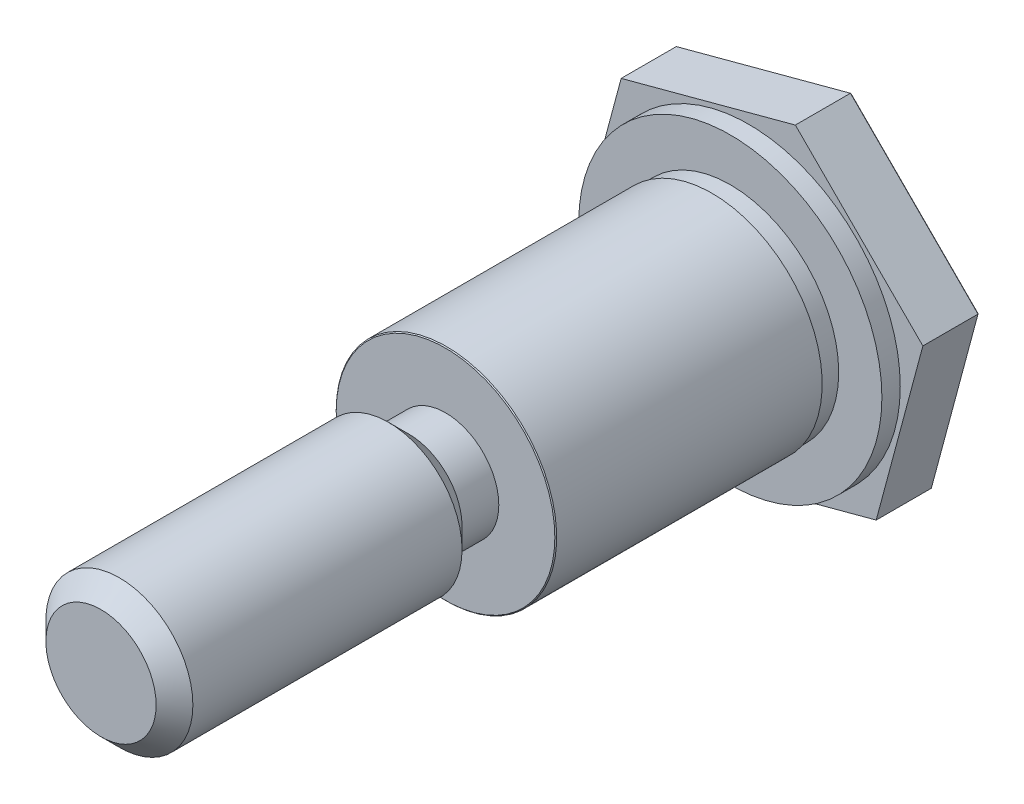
ISO-10303-21;
HEADER;
FILE_DESCRIPTION(('STEP AP214'),'2;1');
FILE_NAME('part.step','',(''),(''),'','','');
FILE_SCHEMA(('AUTOMOTIVE_DESIGN { 1 0 10303 214 1 1 1 1 }'));
ENDSEC;
DATA;
#1=APPLICATION_CONTEXT('core data for automotive mechanical design processes');
#2=APPLICATION_PROTOCOL_DEFINITION('international standard','automotive_design',2000,#1);
#3=PRODUCT_CONTEXT('',#1,'mechanical');
#4=PRODUCT('Part','Part','',(#3));
#5=PRODUCT_RELATED_PRODUCT_CATEGORY('part','',(#4));
#6=PRODUCT_DEFINITION_FORMATION('','',#4);
#7=PRODUCT_DEFINITION_CONTEXT('part definition',#1,'design');
#8=PRODUCT_DEFINITION('design','',#6,#7);
#9=PRODUCT_DEFINITION_SHAPE('','',#8);
#10=(LENGTH_UNIT() NAMED_UNIT(*) SI_UNIT(.MILLI.,.METRE.));
#11=(NAMED_UNIT(*) PLANE_ANGLE_UNIT() SI_UNIT($,.RADIAN.));
#12=(NAMED_UNIT(*) SI_UNIT($,.STERADIAN.) SOLID_ANGLE_UNIT());
#13=UNCERTAINTY_MEASURE_WITH_UNIT(LENGTH_MEASURE(1.E-05),#10,'distance_accuracy_value','');
#14=(GEOMETRIC_REPRESENTATION_CONTEXT(3) GLOBAL_UNCERTAINTY_ASSIGNED_CONTEXT((#13)) GLOBAL_UNIT_ASSIGNED_CONTEXT((#10,
#11,#12)) REPRESENTATION_CONTEXT('',''));
#15=CARTESIAN_POINT('',(0.,0.,0.));
#16=DIRECTION('',(0.,0.,1.));
#17=DIRECTION('',(1.,0.,0.));
#18=AXIS2_PLACEMENT_3D('',#15,#16,#17);
#19=CARTESIAN_POINT('',(0.,0.,19.55));
#20=DIRECTION('',(0.,0.,1.));
#21=DIRECTION('',(1.,0.,0.));
#22=AXIS2_PLACEMENT_3D('',#19,#20,#21);
#23=PLANE('',#22);
#24=CARTESIAN_POINT('',(0.,0.,19.55));
#25=DIRECTION('',(0.,0.,1.));
#26=DIRECTION('',(1.,0.,0.));
#27=AXIS2_PLACEMENT_3D('',#24,#25,#26);
#28=CIRCLE('',#27,5.95);
#29=CARTESIAN_POINT('',(5.95,0.,19.55));
#30=VERTEX_POINT('',#29);
#31=EDGE_CURVE('E144',#30,#30,#28,.T.);
#32=ORIENTED_EDGE('',*,*,#31,.T.);
#33=EDGE_LOOP('',(#32));
#34=FACE_BOUND('',#33,.T.);
#35=CARTESIAN_POINT('',(0.,0.,19.55));
#36=DIRECTION('',(0.,0.,1.));
#37=DIRECTION('',(1.,0.,0.));
#38=AXIS2_PLACEMENT_3D('',#35,#36,#37);
#39=CIRCLE('',#38,2.9);
#40=CARTESIAN_POINT('',(2.9,0.,19.55));
#41=VERTEX_POINT('',#40);
#42=EDGE_CURVE('E199',#41,#41,#39,.T.);
#43=ORIENTED_EDGE('',*,*,#42,.F.);
#44=EDGE_LOOP('',(#43));
#45=FACE_BOUND('',#44,.T.);
#46=ADVANCED_FACE('F32',(#34,#45),#23,.T.);
#47=CARTESIAN_POINT('',(0.,0.,4.05));
#48=DIRECTION('',(0.,0.,1.));
#49=DIRECTION('',(1.,0.,0.));
#50=AXIS2_PLACEMENT_3D('',#47,#48,#49);
#51=PLANE('',#50);
#52=CARTESIAN_POINT('',(0.,0.,4.05));
#53=DIRECTION('',(0.,0.,1.));
#54=DIRECTION('',(1.,0.,0.));
#55=AXIS2_PLACEMENT_3D('',#52,#53,#54);
#56=CIRCLE('',#55,8.25);
#57=CARTESIAN_POINT('',(8.25,0.,4.05));
#58=VERTEX_POINT('',#57);
#59=EDGE_CURVE('E124',#58,#58,#56,.T.);
#60=ORIENTED_EDGE('',*,*,#59,.T.);
#61=EDGE_LOOP('',(#60));
#62=FACE_BOUND('',#61,.T.);
#63=CARTESIAN_POINT('',(0.,0.,4.05));
#64=DIRECTION('',(0.,0.,1.));
#65=DIRECTION('',(1.,0.,0.));
#66=AXIS2_PLACEMENT_3D('',#63,#64,#65);
#67=CIRCLE('',#66,5.9);
#68=CARTESIAN_POINT('',(5.9,0.,4.05));
#69=VERTEX_POINT('',#68);
#70=EDGE_CURVE('E214',#69,#69,#67,.T.);
#71=ORIENTED_EDGE('',*,*,#70,.F.);
#72=EDGE_LOOP('',(#71));
#73=FACE_BOUND('',#72,.T.);
#74=ADVANCED_FACE('F267',(#62,#73),#51,.T.);
#75=CARTESIAN_POINT('',(-2.54029717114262,-9.48051810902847,3.05));
#76=DIRECTION('',(0.,0.,-1.));
#77=DIRECTION('',(-1.,0.,0.));
#78=AXIS2_PLACEMENT_3D('',#75,#76,#77);
#79=PLANE('',#78);
#80=DIRECTION('',(0.965925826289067,0.258819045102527,0.));
#81=VECTOR('',#80,1.);
#82=CARTESIAN_POINT('',(-2.54029717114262,-9.48051810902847,3.05));
#83=LINE('',#82,#81);
#84=CARTESIAN_POINT('',(-2.54029717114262,-9.48051810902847,3.05));
#85=VERTEX_POINT('',#84);
#86=CARTESIAN_POINT('',(6.94022093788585,-6.94022093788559,3.05));
#87=VERTEX_POINT('',#86);
#88=EDGE_CURVE('E116',#85,#87,#83,.T.);
#89=ORIENTED_EDGE('',*,*,#88,.T.);
#90=DIRECTION('',(0.258819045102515,0.96592582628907,0.));
#91=VECTOR('',#90,1.);
#92=CARTESIAN_POINT('',(6.94022093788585,-6.94022093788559,3.05));
#93=LINE('',#92,#91);
#94=CARTESIAN_POINT('',(9.48051810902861,2.54029717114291,3.05));
#95=VERTEX_POINT('',#94);
#96=EDGE_CURVE('E104',#87,#95,#93,.T.);
#97=ORIENTED_EDGE('',*,*,#96,.T.);
#98=DIRECTION('',(-0.707106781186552,0.707106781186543,0.));
#99=VECTOR('',#98,1.);
#100=CARTESIAN_POINT('',(9.48051810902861,2.54029717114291,3.05));
#101=LINE('',#100,#99);
#102=CARTESIAN_POINT('',(2.5402971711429,9.48051810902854,3.05));
#103=VERTEX_POINT('',#102);
#104=EDGE_CURVE('E115',#95,#103,#101,.T.);
#105=ORIENTED_EDGE('',*,*,#104,.T.);
#106=DIRECTION('',(-0.965925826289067,-0.258819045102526,0.));
#107=VECTOR('',#106,1.);
#108=CARTESIAN_POINT('',(2.5402971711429,9.48051810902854,3.05));
#109=LINE('',#108,#107);
#110=CARTESIAN_POINT('',(-6.94022093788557,6.94022093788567,3.05));
#111=VERTEX_POINT('',#110);
#112=EDGE_CURVE('E223',#103,#111,#109,.T.);
#113=ORIENTED_EDGE('',*,*,#112,.T.);
#114=DIRECTION('',(-0.258819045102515,-0.96592582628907,0.));
#115=VECTOR('',#114,1.);
#116=CARTESIAN_POINT('',(-6.94022093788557,6.94022093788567,3.05));
#117=LINE('',#116,#115);
#118=CARTESIAN_POINT('',(-9.48051810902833,-2.54029717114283,3.05));
#119=VERTEX_POINT('',#118);
#120=EDGE_CURVE('E184',#111,#119,#117,.T.);
#121=ORIENTED_EDGE('',*,*,#120,.T.);
#122=DIRECTION('',(0.707106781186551,-0.707106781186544,0.));
#123=VECTOR('',#122,1.);
#124=CARTESIAN_POINT('',(-9.48051810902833,-2.54029717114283,3.05));
#125=LINE('',#124,#123);
#126=EDGE_CURVE('E122',#119,#85,#125,.T.);
#127=ORIENTED_EDGE('',*,*,#126,.T.);
#128=EDGE_LOOP('',(#89,#97,#105,#113,#121,#127));
#129=FACE_BOUND('',#128,.T.);
#130=CARTESIAN_POINT('',(0.,0.,3.05));
#131=DIRECTION('',(0.,0.,-1.));
#132=DIRECTION('',(-1.,0.,0.));
#133=AXIS2_PLACEMENT_3D('',#130,#131,#132);
#134=CIRCLE('',#133,8.25);
#135=CARTESIAN_POINT('',(-8.25,0.,3.05));
#136=VERTEX_POINT('',#135);
#137=EDGE_CURVE('E127',#136,#136,#134,.F.);
#138=ORIENTED_EDGE('',*,*,#137,.F.);
#139=EDGE_LOOP('',(#138));
#140=FACE_BOUND('',#139,.T.);
#141=ADVANCED_FACE('F119',(#129,#140),#79,.F.);
#142=CARTESIAN_POINT('',(-2.54029717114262,-9.48051810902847,3.05));
#143=DIRECTION('',(-0.258819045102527,0.965925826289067,0.));
#144=DIRECTION('',(-0.965925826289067,-0.258819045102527,0.));
#145=AXIS2_PLACEMENT_3D('',#142,#143,#144);
#146=PLANE('',#145);
#147=DIRECTION('',(0.,0.,-1.));
#148=VECTOR('',#147,1.);
#149=CARTESIAN_POINT('',(-2.54029717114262,-9.48051810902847,3.05));
#150=LINE('',#149,#148);
#151=CARTESIAN_POINT('',(-2.54029717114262,-9.48051810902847,0.0500000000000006));
#152=VERTEX_POINT('',#151);
#153=EDGE_CURVE('E227',#85,#152,#150,.T.);
#154=ORIENTED_EDGE('',*,*,#153,.T.);
#155=DIRECTION('',(0.965925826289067,0.258819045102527,0.));
#156=VECTOR('',#155,1.);
#157=CARTESIAN_POINT('',(6.94022093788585,-6.94022093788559,0.0500000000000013));
#158=LINE('',#157,#156);
#159=CARTESIAN_POINT('',(6.94022093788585,-6.94022093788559,0.0500000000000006));
#160=VERTEX_POINT('',#159);
#161=EDGE_CURVE('E11',#152,#160,#158,.T.);
#162=ORIENTED_EDGE('',*,*,#161,.T.);
#163=DIRECTION('',(0.,0.,-1.));
#164=VECTOR('',#163,1.);
#165=CARTESIAN_POINT('',(6.94022093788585,-6.94022093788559,3.05));
#166=LINE('',#165,#164);
#167=EDGE_CURVE('E109',#87,#160,#166,.T.);
#168=ORIENTED_EDGE('',*,*,#167,.F.);
#169=ORIENTED_EDGE('',*,*,#88,.F.);
#170=EDGE_LOOP('',(#154,#162,#168,#169));
#171=FACE_BOUND('',#170,.T.);
#172=ADVANCED_FACE('F34',(#171),#146,.F.);
#173=CARTESIAN_POINT('',(6.94022093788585,-6.94022093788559,3.05));
#174=DIRECTION('',(-0.96592582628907,0.258819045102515,0.));
#175=DIRECTION('',(-0.258819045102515,-0.96592582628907,0.));
#176=AXIS2_PLACEMENT_3D('',#173,#174,#175);
#177=PLANE('',#176);
#178=ORIENTED_EDGE('',*,*,#167,.T.);
#179=DIRECTION('',(0.258819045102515,0.96592582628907,0.));
#180=VECTOR('',#179,1.);
#181=CARTESIAN_POINT('',(9.48051810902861,2.54029717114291,0.0500000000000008));
#182=LINE('',#181,#180);
#183=CARTESIAN_POINT('',(9.48051810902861,2.54029717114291,0.0500000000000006));
#184=VERTEX_POINT('',#183);
#185=EDGE_CURVE('E151',#160,#184,#182,.T.);
#186=ORIENTED_EDGE('',*,*,#185,.T.);
#187=DIRECTION('',(0.,0.,-1.));
#188=VECTOR('',#187,1.);
#189=CARTESIAN_POINT('',(9.48051810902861,2.54029717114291,3.05));
#190=LINE('',#189,#188);
#191=EDGE_CURVE('E112',#95,#184,#190,.T.);
#192=ORIENTED_EDGE('',*,*,#191,.F.);
#193=ORIENTED_EDGE('',*,*,#96,.F.);
#194=EDGE_LOOP('',(#178,#186,#192,#193));
#195=FACE_BOUND('',#194,.T.);
#196=ADVANCED_FACE('F106',(#195),#177,.F.);
#197=CARTESIAN_POINT('',(9.48051810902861,2.54029717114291,3.05));
#198=DIRECTION('',(-0.707106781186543,-0.707106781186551,0.));
#199=DIRECTION('',(0.707106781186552,-0.707106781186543,0.));
#200=AXIS2_PLACEMENT_3D('',#197,#198,#199);
#201=PLANE('',#200);
#202=ORIENTED_EDGE('',*,*,#191,.T.);
#203=DIRECTION('',(-0.707106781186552,0.707106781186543,0.));
#204=VECTOR('',#203,1.);
#205=CARTESIAN_POINT('',(2.5402971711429,9.48051810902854,0.0500000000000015));
#206=LINE('',#205,#204);
#207=CARTESIAN_POINT('',(2.5402971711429,9.48051810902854,0.0500000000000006));
#208=VERTEX_POINT('',#207);
#209=EDGE_CURVE('E166',#184,#208,#206,.T.);
#210=ORIENTED_EDGE('',*,*,#209,.T.);
#211=DIRECTION('',(0.,0.,-1.));
#212=VECTOR('',#211,1.);
#213=CARTESIAN_POINT('',(2.5402971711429,9.48051810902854,3.05));
#214=LINE('',#213,#212);
#215=EDGE_CURVE('E132',#103,#208,#214,.T.);
#216=ORIENTED_EDGE('',*,*,#215,.F.);
#217=ORIENTED_EDGE('',*,*,#104,.F.);
#218=EDGE_LOOP('',(#202,#210,#216,#217));
#219=FACE_BOUND('',#218,.T.);
#220=ADVANCED_FACE('F247',(#219),#201,.F.);
#221=CARTESIAN_POINT('',(2.5402971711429,9.48051810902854,3.05));
#222=DIRECTION('',(0.258819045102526,-0.965925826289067,0.));
#223=DIRECTION('',(0.965925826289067,0.258819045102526,0.));
#224=AXIS2_PLACEMENT_3D('',#221,#222,#223);
#225=PLANE('',#224);
#226=ORIENTED_EDGE('',*,*,#215,.T.);
#227=DIRECTION('',(-0.965925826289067,-0.258819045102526,0.));
#228=VECTOR('',#227,1.);
#229=CARTESIAN_POINT('',(-6.94022093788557,6.94022093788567,0.050000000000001));
#230=LINE('',#229,#228);
#231=CARTESIAN_POINT('',(-6.94022093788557,6.94022093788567,0.0500000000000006));
#232=VERTEX_POINT('',#231);
#233=EDGE_CURVE('E168',#208,#232,#230,.T.);
#234=ORIENTED_EDGE('',*,*,#233,.T.);
#235=DIRECTION('',(0.,0.,-1.));
#236=VECTOR('',#235,1.);
#237=CARTESIAN_POINT('',(-6.94022093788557,6.94022093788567,3.05));
#238=LINE('',#237,#236);
#239=EDGE_CURVE('E176',#111,#232,#238,.T.);
#240=ORIENTED_EDGE('',*,*,#239,.F.);
#241=ORIENTED_EDGE('',*,*,#112,.F.);
#242=EDGE_LOOP('',(#226,#234,#240,#241));
#243=FACE_BOUND('',#242,.T.);
#244=ADVANCED_FACE('F174',(#243),#225,.F.);
#245=CARTESIAN_POINT('',(-6.94022093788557,6.94022093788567,3.05));
#246=DIRECTION('',(0.96592582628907,-0.258819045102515,0.));
#247=DIRECTION('',(0.258819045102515,0.96592582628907,0.));
#248=AXIS2_PLACEMENT_3D('',#245,#246,#247);
#249=PLANE('',#248);
#250=ORIENTED_EDGE('',*,*,#239,.T.);
#251=DIRECTION('',(-0.258819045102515,-0.96592582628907,0.));
#252=VECTOR('',#251,1.);
#253=CARTESIAN_POINT('',(-9.48051810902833,-2.54029717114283,0.050000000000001));
#254=LINE('',#253,#252);
#255=CARTESIAN_POINT('',(-9.48051810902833,-2.54029717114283,0.0500000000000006));
#256=VERTEX_POINT('',#255);
#257=EDGE_CURVE('E54',#232,#256,#254,.T.);
#258=ORIENTED_EDGE('',*,*,#257,.T.);
#259=DIRECTION('',(0.,0.,-1.));
#260=VECTOR('',#259,1.);
#261=CARTESIAN_POINT('',(-9.48051810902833,-2.54029717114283,3.05));
#262=LINE('',#261,#260);
#263=EDGE_CURVE('E185',#119,#256,#262,.T.);
#264=ORIENTED_EDGE('',*,*,#263,.F.);
#265=ORIENTED_EDGE('',*,*,#120,.F.);
#266=EDGE_LOOP('',(#250,#258,#264,#265));
#267=FACE_BOUND('',#266,.T.);
#268=ADVANCED_FACE('F183',(#267),#249,.F.);
#269=CARTESIAN_POINT('',(-9.48051810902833,-2.54029717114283,3.05));
#270=DIRECTION('',(0.707106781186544,0.707106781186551,0.));
#271=DIRECTION('',(-0.707106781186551,0.707106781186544,0.));
#272=AXIS2_PLACEMENT_3D('',#269,#270,#271);
#273=PLANE('',#272);
#274=ORIENTED_EDGE('',*,*,#263,.T.);
#275=DIRECTION('',(0.707106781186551,-0.707106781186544,0.));
#276=VECTOR('',#275,1.);
#277=CARTESIAN_POINT('',(-2.54029717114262,-9.48051810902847,0.050000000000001));
#278=LINE('',#277,#276);
#279=EDGE_CURVE('E40',#256,#152,#278,.T.);
#280=ORIENTED_EDGE('',*,*,#279,.T.);
#281=ORIENTED_EDGE('',*,*,#153,.F.);
#282=ORIENTED_EDGE('',*,*,#126,.F.);
#283=EDGE_LOOP('',(#274,#280,#281,#282));
#284=FACE_BOUND('',#283,.T.);
#285=ADVANCED_FACE('F229',(#284),#273,.F.);
#286=CARTESIAN_POINT('',(-2.54029717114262,-9.48051810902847,0.));
#287=DIRECTION('',(0.,0.,-1.));
#288=DIRECTION('',(-1.,0.,0.));
#289=AXIS2_PLACEMENT_3D('',#286,#287,#288);
#290=PLANE('',#289);
#291=DIRECTION('',(0.707106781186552,-0.707106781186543,0.));
#292=VECTOR('',#291,1.);
#293=CARTESIAN_POINT('',(9.44516276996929,2.50494183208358,0.));
#294=LINE('',#293,#292);
#295=CARTESIAN_POINT('',(2.52535424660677,9.42475035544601,0.));
#296=VERTEX_POINT('',#295);
#297=CARTESIAN_POINT('',(9.42475035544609,2.52535424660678,0.));
#298=VERTEX_POINT('',#297);
#299=EDGE_CURVE('E161',#296,#298,#294,.T.);
#300=ORIENTED_EDGE('',*,*,#299,.T.);
#301=DIRECTION('',(-0.258819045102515,-0.96592582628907,0.));
#302=VECTOR('',#301,1.);
#303=CARTESIAN_POINT('',(6.89192464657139,-6.92727998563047,0.));
#304=LINE('',#303,#302);
#305=CARTESIAN_POINT('',(6.89939610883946,-6.89939610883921,0.));
#306=VERTEX_POINT('',#305);
#307=EDGE_CURVE('E163',#298,#306,#304,.T.);
#308=ORIENTED_EDGE('',*,*,#307,.T.);
#309=DIRECTION('',(-0.965925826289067,-0.258819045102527,0.));
#310=VECTOR('',#309,1.);
#311=CARTESIAN_POINT('',(-2.55323812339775,-9.43222181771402,0.));
#312=LINE('',#311,#310);
#313=CARTESIAN_POINT('',(-2.52535424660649,-9.42475035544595,0.));
#314=VERTEX_POINT('',#313);
#315=EDGE_CURVE('E153',#306,#314,#312,.T.);
#316=ORIENTED_EDGE('',*,*,#315,.T.);
#317=DIRECTION('',(-0.707106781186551,0.707106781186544,0.));
#318=VECTOR('',#317,1.);
#319=CARTESIAN_POINT('',(-9.44516276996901,-2.5049418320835,0.));
#320=LINE('',#319,#318);
#321=CARTESIAN_POINT('',(-9.42475035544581,-2.52535424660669,0.));
#322=VERTEX_POINT('',#321);
#323=EDGE_CURVE('E155',#314,#322,#320,.T.);
#324=ORIENTED_EDGE('',*,*,#323,.T.);
#325=DIRECTION('',(0.258819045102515,0.96592582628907,0.));
#326=VECTOR('',#325,1.);
#327=CARTESIAN_POINT('',(-6.89192464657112,6.92727998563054,0.));
#328=LINE('',#327,#326);
#329=CARTESIAN_POINT('',(-6.89939610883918,6.89939610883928,0.));
#330=VERTEX_POINT('',#329);
#331=EDGE_CURVE('E157',#322,#330,#328,.T.);
#332=ORIENTED_EDGE('',*,*,#331,.T.);
#333=DIRECTION('',(0.965925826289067,0.258819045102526,0.));
#334=VECTOR('',#333,1.);
#335=CARTESIAN_POINT('',(2.55323812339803,9.43222181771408,0.));
#336=LINE('',#335,#334);
#337=EDGE_CURVE('E159',#330,#296,#336,.T.);
#338=ORIENTED_EDGE('',*,*,#337,.T.);
#339=EDGE_LOOP('',(#300,#308,#316,#324,#332,#338));
#340=FACE_BOUND('',#339,.T.);
#341=ADVANCED_FACE('F253',(#340),#290,.T.);
#342=CARTESIAN_POINT('',(0.,0.,4.05));
#343=DIRECTION('',(0.,0.,-1.));
#344=DIRECTION('',(-1.,0.,0.));
#345=AXIS2_PLACEMENT_3D('',#342,#343,#344);
#346=CYLINDRICAL_SURFACE('',#345,8.25);
#347=ORIENTED_EDGE('',*,*,#59,.F.);
#348=EDGE_LOOP('',(#347));
#349=FACE_BOUND('',#348,.T.);
#350=ORIENTED_EDGE('',*,*,#137,.T.);
#351=EDGE_LOOP('',(#350));
#352=FACE_BOUND('',#351,.T.);
#353=ADVANCED_FACE('F255',(#349,#352),#346,.T.);
#354=CARTESIAN_POINT('',(0.,0.,5.05));
#355=DIRECTION('',(0.,0.,-1.));
#356=DIRECTION('',(-1.,0.,0.));
#357=AXIS2_PLACEMENT_3D('',#354,#355,#356);
#358=CYLINDRICAL_SURFACE('',#357,5.9);
#359=CARTESIAN_POINT('',(0.,0.,5.05));
#360=DIRECTION('',(0.,0.,1.));
#361=DIRECTION('',(1.,0.,0.));
#362=AXIS2_PLACEMENT_3D('',#359,#360,#361);
#363=CIRCLE('',#362,5.9);
#364=CARTESIAN_POINT('',(5.9,0.,5.05));
#365=VERTEX_POINT('',#364);
#366=EDGE_CURVE('E217',#365,#365,#363,.T.);
#367=ORIENTED_EDGE('',*,*,#366,.F.);
#368=EDGE_LOOP('',(#367));
#369=FACE_BOUND('',#368,.T.);
#370=ORIENTED_EDGE('',*,*,#70,.T.);
#371=EDGE_LOOP('',(#370));
#372=FACE_BOUND('',#371,.T.);
#373=ADVANCED_FACE('F261',(#369,#372),#358,.T.);
#374=CARTESIAN_POINT('',(0.,0.,5.05));
#375=DIRECTION('',(0.,0.,1.));
#376=DIRECTION('',(1.,0.,0.));
#377=AXIS2_PLACEMENT_3D('',#374,#375,#376);
#378=PLANE('',#377);
#379=CARTESIAN_POINT('',(0.,0.,5.05));
#380=DIRECTION('',(0.,0.,1.));
#381=DIRECTION('',(1.,0.,0.));
#382=AXIS2_PLACEMENT_3D('',#379,#380,#381);
#383=CIRCLE('',#382,6.);
#384=CARTESIAN_POINT('',(-6.,0.,5.05));
#385=VERTEX_POINT('',#384);
#386=EDGE_CURVE('E211',#385,#385,#383,.T.);
#387=ORIENTED_EDGE('',*,*,#386,.F.);
#388=EDGE_LOOP('',(#387));
#389=FACE_BOUND('',#388,.T.);
#390=ORIENTED_EDGE('',*,*,#366,.T.);
#391=EDGE_LOOP('',(#390));
#392=FACE_BOUND('',#391,.T.);
#393=ADVANCED_FACE('F278',(#389,#392),#378,.F.);
#394=CARTESIAN_POINT('',(0.,0.,19.55));
#395=DIRECTION('',(0.,0.,-1.));
#396=DIRECTION('',(-1.,0.,0.));
#397=AXIS2_PLACEMENT_3D('',#394,#395,#396);
#398=CYLINDRICAL_SURFACE('',#397,6.);
#399=CARTESIAN_POINT('',(0.,0.,19.5));
#400=DIRECTION('',(0.,0.,1.));
#401=DIRECTION('',(1.,0.,0.));
#402=AXIS2_PLACEMENT_3D('',#399,#400,#401);
#403=CIRCLE('',#402,6.);
#404=CARTESIAN_POINT('',(-6.,0.,19.5));
#405=VERTEX_POINT('',#404);
#406=EDGE_CURVE('E147',#405,#405,#403,.F.);
#407=CARTESIAN_POINT('',(-6.,0.,19.5));
#408=CARTESIAN_POINT('',(-6.,0.,19.3494791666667));
#409=CARTESIAN_POINT('',(-6.,0.,19.1989583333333));
#410=CARTESIAN_POINT('',(-6.,0.,18.8979166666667));
#411=CARTESIAN_POINT('',(-6.,0.,18.7473958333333));
#412=CARTESIAN_POINT('',(-6.,0.,18.4463541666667));
#413=CARTESIAN_POINT('',(-6.,0.,18.2958333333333));
#414=CARTESIAN_POINT('',(-6.,0.,17.9947916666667));
#415=CARTESIAN_POINT('',(-6.,0.,17.8442708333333));
#416=CARTESIAN_POINT('',(-6.,0.,17.5432291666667));
#417=CARTESIAN_POINT('',(-6.,0.,17.3927083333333));
#418=CARTESIAN_POINT('',(-6.,0.,17.0916666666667));
#419=CARTESIAN_POINT('',(-6.,0.,16.9411458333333));
#420=CARTESIAN_POINT('',(-6.,0.,16.6401041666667));
#421=CARTESIAN_POINT('',(-6.,0.,16.4895833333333));
#422=CARTESIAN_POINT('',(-6.,0.,16.1885416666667));
#423=CARTESIAN_POINT('',(-6.,0.,16.0380208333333));
#424=CARTESIAN_POINT('',(-6.,0.,15.7369791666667));
#425=CARTESIAN_POINT('',(-6.,0.,15.5864583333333));
#426=CARTESIAN_POINT('',(-6.,0.,15.2854166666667));
#427=CARTESIAN_POINT('',(-6.,0.,15.1348958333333));
#428=CARTESIAN_POINT('',(-6.,0.,14.8338541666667));
#429=CARTESIAN_POINT('',(-6.,0.,14.6833333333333));
#430=CARTESIAN_POINT('',(-6.,0.,14.3822916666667));
#431=CARTESIAN_POINT('',(-6.,0.,14.2317708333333));
#432=CARTESIAN_POINT('',(-6.,0.,13.9307291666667));
#433=CARTESIAN_POINT('',(-6.,0.,13.7802083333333));
#434=CARTESIAN_POINT('',(-6.,0.,13.4791666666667));
#435=CARTESIAN_POINT('',(-6.,0.,13.3286458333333));
#436=CARTESIAN_POINT('',(-6.,0.,13.0276041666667));
#437=CARTESIAN_POINT('',(-6.,0.,12.8770833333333));
#438=CARTESIAN_POINT('',(-6.,0.,12.5760416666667));
#439=CARTESIAN_POINT('',(-6.,0.,12.4255208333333));
#440=CARTESIAN_POINT('',(-6.,0.,12.1244791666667));
#441=CARTESIAN_POINT('',(-6.,0.,11.9739583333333));
#442=CARTESIAN_POINT('',(-6.,0.,11.6729166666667));
#443=CARTESIAN_POINT('',(-6.,0.,11.5223958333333));
#444=CARTESIAN_POINT('',(-6.,0.,11.2213541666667));
#445=CARTESIAN_POINT('',(-6.,0.,11.0708333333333));
#446=CARTESIAN_POINT('',(-6.,0.,10.7697916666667));
#447=CARTESIAN_POINT('',(-6.,0.,10.6192708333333));
#448=CARTESIAN_POINT('',(-6.,0.,10.3182291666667));
#449=CARTESIAN_POINT('',(-6.,0.,10.1677083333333));
#450=CARTESIAN_POINT('',(-6.,0.,9.86666666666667));
#451=CARTESIAN_POINT('',(-6.,0.,9.71614583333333));
#452=CARTESIAN_POINT('',(-6.,0.,9.41510416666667));
#453=CARTESIAN_POINT('',(-6.,0.,9.26458333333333));
#454=CARTESIAN_POINT('',(-6.,0.,8.96354166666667));
#455=CARTESIAN_POINT('',(-6.,0.,8.81302083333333));
#456=CARTESIAN_POINT('',(-6.,0.,8.51197916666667));
#457=CARTESIAN_POINT('',(-6.,0.,8.36145833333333));
#458=CARTESIAN_POINT('',(-6.,0.,8.06041666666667));
#459=CARTESIAN_POINT('',(-6.,0.,7.90989583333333));
#460=CARTESIAN_POINT('',(-6.,0.,7.60885416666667));
#461=CARTESIAN_POINT('',(-6.,0.,7.45833333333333));
#462=CARTESIAN_POINT('',(-6.,0.,7.15729166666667));
#463=CARTESIAN_POINT('',(-6.,0.,7.00677083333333));
#464=CARTESIAN_POINT('',(-6.,0.,6.70572916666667));
#465=CARTESIAN_POINT('',(-6.,0.,6.55520833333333));
#466=CARTESIAN_POINT('',(-6.,0.,6.25416666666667));
#467=CARTESIAN_POINT('',(-6.,0.,6.10364583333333));
#468=CARTESIAN_POINT('',(-6.,0.,5.80260416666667));
#469=CARTESIAN_POINT('',(-6.,0.,5.65208333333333));
#470=CARTESIAN_POINT('',(-6.,0.,5.35104166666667));
#471=CARTESIAN_POINT('',(-6.,0.,5.20052083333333));
#472=CARTESIAN_POINT('',(-6.,0.,5.05));
#473=B_SPLINE_CURVE_WITH_KNOTS('',3,(#407,#408,#409,#410,#411,#412,#413,#414,#415,#416,#417,
#418,#419,#420,#421,#422,#423,#424,#425,#426,#427,#428,#429,#430,#431,#432,#433,#434,#435,#436,
#437,#438,#439,#440,#441,#442,#443,#444,#445,#446,#447,#448,#449,#450,#451,#452,#453,#454,#455,
#456,#457,#458,#459,#460,#461,#462,#463,#464,#465,#466,#467,#468,#469,#470,#471,#472),
.UNSPECIFIED.,.F.,.F.,(4,2,2,2,2,2,2,2,2,2,2,2,2,2,2,2,2,2,2,2,2,2,2,2,2,2,2,2,2,2,2,2,4),(0.,
0.451562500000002,0.903125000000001,1.3546875,1.80625,2.2578125,2.709375,3.1609375,3.6125,
4.0640625,4.515625,4.9671875,5.41875,5.8703125,6.321875,6.7734375,7.225,7.6765625,8.128125,
8.5796875,9.03125,9.4828125,9.934375,10.3859375,10.8375,11.2890625,11.740625,12.1921875,
12.64375,13.0953125,13.546875,13.9984375,14.45),.UNSPECIFIED.);
#474=EDGE_CURVE('BSEAM280',#405,#385,#473,.T.);
#475=ORIENTED_EDGE('',*,*,#406,.T.);
#476=ORIENTED_EDGE('',*,*,#386,.T.);
#477=ORIENTED_EDGE('',*,*,#474,.T.);
#478=ORIENTED_EDGE('',*,*,#474,.F.);
#479=EDGE_LOOP('',(#475,#477,#476,#478));
#480=FACE_BOUND('',#479,.T.);
#481=ADVANCED_FACE('F280',(#480),#398,.T.);
#482=CARTESIAN_POINT('',(0.,0.,21.55));
#483=DIRECTION('',(0.,0.,-1.));
#484=DIRECTION('',(-1.,0.,0.));
#485=AXIS2_PLACEMENT_3D('',#482,#483,#484);
#486=CYLINDRICAL_SURFACE('',#485,2.9);
#487=CARTESIAN_POINT('',(0.,0.,21.55));
#488=DIRECTION('',(0.,0.,1.));
#489=DIRECTION('',(1.,0.,0.));
#490=AXIS2_PLACEMENT_3D('',#487,#488,#489);
#491=CIRCLE('',#490,2.9);
#492=CARTESIAN_POINT('',(2.9,0.,21.55));
#493=VERTEX_POINT('',#492);
#494=EDGE_CURVE('E208',#493,#493,#491,.T.);
#495=ORIENTED_EDGE('',*,*,#494,.F.);
#496=EDGE_LOOP('',(#495));
#497=FACE_BOUND('',#496,.T.);
#498=ORIENTED_EDGE('',*,*,#42,.T.);
#499=EDGE_LOOP('',(#498));
#500=FACE_BOUND('',#499,.T.);
#501=ADVANCED_FACE('F283',(#497,#500),#486,.T.);
#502=CARTESIAN_POINT('',(0.,0.,38.3));
#503=DIRECTION('',(0.,0.,-1.));
#504=DIRECTION('',(-1.,0.,0.));
#505=AXIS2_PLACEMENT_3D('',#502,#503,#504);
#506=CYLINDRICAL_SURFACE('',#505,4.);
#507=CARTESIAN_POINT('',(0.,0.,37.3));
#508=DIRECTION('',(0.,0.,1.));
#509=DIRECTION('',(1.,0.,0.));
#510=AXIS2_PLACEMENT_3D('',#507,#508,#509);
#511=CIRCLE('',#510,4.);
#512=CARTESIAN_POINT('',(4.,0.,37.3));
#513=VERTEX_POINT('',#512);
#514=EDGE_CURVE('E141',#513,#513,#511,.F.);
#515=ORIENTED_EDGE('',*,*,#514,.T.);
#516=EDGE_LOOP('',(#515));
#517=FACE_BOUND('',#516,.T.);
#518=CARTESIAN_POINT('',(0.,0.,22.65));
#519=DIRECTION('',(0.,0.,1.));
#520=DIRECTION('',(1.,0.,0.));
#521=AXIS2_PLACEMENT_3D('',#518,#519,#520);
#522=CIRCLE('',#521,4.);
#523=CARTESIAN_POINT('',(4.,0.,22.65));
#524=VERTEX_POINT('',#523);
#525=EDGE_CURVE('E130',#524,#524,#522,.T.);
#526=ORIENTED_EDGE('',*,*,#525,.T.);
#527=EDGE_LOOP('',(#526));
#528=FACE_BOUND('',#527,.T.);
#529=ADVANCED_FACE('F311',(#517,#528),#506,.T.);
#530=CARTESIAN_POINT('',(0.,0.,38.3));
#531=DIRECTION('',(0.,0.,1.));
#532=DIRECTION('',(1.,0.,0.));
#533=AXIS2_PLACEMENT_3D('',#530,#531,#532);
#534=PLANE('',#533);
#535=CARTESIAN_POINT('',(0.,0.,38.3));
#536=DIRECTION('',(0.,0.,1.));
#537=DIRECTION('',(1.,0.,0.));
#538=AXIS2_PLACEMENT_3D('',#535,#536,#537);
#539=CIRCLE('',#538,3.);
#540=CARTESIAN_POINT('',(3.,0.,38.3));
#541=VERTEX_POINT('',#540);
#542=EDGE_CURVE('E138',#541,#541,#539,.T.);
#543=ORIENTED_EDGE('',*,*,#542,.T.);
#544=EDGE_LOOP('',(#543));
#545=FACE_BOUND('',#544,.T.);
#546=ADVANCED_FACE('F319',(#545),#534,.T.);
#547=CARTESIAN_POINT('',(0.,0.,22.65));
#548=DIRECTION('',(0.,0.,1.));
#549=DIRECTION('',(1.,0.,0.));
#550=AXIS2_PLACEMENT_3D('',#547,#548,#549);
#551=CONICAL_SURFACE('',#550,4.,0.78539816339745);
#552=ORIENTED_EDGE('',*,*,#494,.T.);
#553=EDGE_LOOP('',(#552));
#554=FACE_BOUND('',#553,.T.);
#555=ORIENTED_EDGE('',*,*,#525,.F.);
#556=EDGE_LOOP('',(#555));
#557=FACE_BOUND('',#556,.T.);
#558=ADVANCED_FACE('F327',(#554,#557),#551,.T.);
#559=CARTESIAN_POINT('',(0.,0.,38.3));
#560=DIRECTION('',(0.,0.,-1.));
#561=DIRECTION('',(-1.,0.,0.));
#562=AXIS2_PLACEMENT_3D('',#559,#560,#561);
#563=CONICAL_SURFACE('',#562,3.,0.785398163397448);
#564=ORIENTED_EDGE('',*,*,#514,.F.);
#565=EDGE_LOOP('',(#564));
#566=FACE_BOUND('',#565,.T.);
#567=ORIENTED_EDGE('',*,*,#542,.F.);
#568=EDGE_LOOP('',(#567));
#569=FACE_BOUND('',#568,.T.);
#570=ADVANCED_FACE('F335',(#566,#569),#563,.T.);
#571=CARTESIAN_POINT('',(0.,0.,19.55));
#572=DIRECTION('',(0.,0.,-1.));
#573=DIRECTION('',(-1.,0.,0.));
#574=AXIS2_PLACEMENT_3D('',#571,#572,#573);
#575=CONICAL_SURFACE('',#574,5.95,0.78539816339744);
#576=ORIENTED_EDGE('',*,*,#406,.F.);
#577=EDGE_LOOP('',(#576));
#578=FACE_BOUND('',#577,.T.);
#579=ORIENTED_EDGE('',*,*,#31,.F.);
#580=EDGE_LOOP('',(#579));
#581=FACE_BOUND('',#580,.T.);
#582=ADVANCED_FACE('F342',(#578,#581),#575,.T.);
#583=CARTESIAN_POINT('',(-6.94022093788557,6.94022093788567,0.050000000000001));
#584=DIRECTION('',(-0.683012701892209,0.183012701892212,-0.70710678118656));
#585=DIRECTION('',(-0.719254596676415,0.,0.694746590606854));
#586=AXIS2_PLACEMENT_3D('',#583,#584,#585);
#587=PLANE('',#586);
#588=DIRECTION('',(0.534522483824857,-0.534522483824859,-0.654653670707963));
#589=VECTOR('',#588,1.);
#590=CARTESIAN_POINT('',(-6.94022093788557,6.94022093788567,0.050000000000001));
#591=LINE('',#590,#589);
#592=EDGE_CURVE('E192',#330,#232,#591,.F.);
#593=ORIENTED_EDGE('',*,*,#592,.F.);
#594=ORIENTED_EDGE('',*,*,#331,.F.);
#595=DIRECTION('',(0.73017129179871,0.195648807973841,-0.654653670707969));
#596=VECTOR('',#595,1.);
#597=CARTESIAN_POINT('',(-9.48051810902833,-2.54029717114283,0.050000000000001));
#598=LINE('',#597,#596);
#599=EDGE_CURVE('E195',#256,#322,#598,.T.);
#600=ORIENTED_EDGE('',*,*,#599,.F.);
#601=ORIENTED_EDGE('',*,*,#257,.F.);
#602=EDGE_LOOP('',(#593,#594,#600,#601));
#603=FACE_BOUND('',#602,.T.);
#604=ADVANCED_FACE('F190',(#603),#587,.T.);
#605=CARTESIAN_POINT('',(-9.48051810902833,-2.54029717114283,0.050000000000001));
#606=DIRECTION('',(-0.499999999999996,-0.5,-0.707106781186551));
#607=DIRECTION('',(0.,0.816496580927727,-0.577350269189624));
#608=AXIS2_PLACEMENT_3D('',#605,#606,#607);
#609=PLANE('',#608);
#610=ORIENTED_EDGE('',*,*,#599,.T.);
#611=ORIENTED_EDGE('',*,*,#323,.F.);
#612=DIRECTION('',(0.195648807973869,0.730171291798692,-0.654653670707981));
#613=VECTOR('',#612,1.);
#614=CARTESIAN_POINT('',(-2.54029717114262,-9.48051810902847,0.050000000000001));
#615=LINE('',#614,#613);
#616=EDGE_CURVE('E197',#152,#314,#615,.T.);
#617=ORIENTED_EDGE('',*,*,#616,.F.);
#618=ORIENTED_EDGE('',*,*,#279,.F.);
#619=EDGE_LOOP('',(#610,#611,#617,#618));
#620=FACE_BOUND('',#619,.T.);
#621=ADVANCED_FACE('F233',(#620),#609,.T.);
#622=CARTESIAN_POINT('',(2.5402971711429,9.48051810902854,0.050000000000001));
#623=DIRECTION('',(-0.183012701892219,0.683012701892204,-0.707106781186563));
#624=DIRECTION('',(0.,0.719254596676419,0.69474659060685));
#625=AXIS2_PLACEMENT_3D('',#622,#623,#624);
#626=PLANE('',#625);
#627=ORIENTED_EDGE('',*,*,#592,.T.);
#628=ORIENTED_EDGE('',*,*,#233,.F.);
#629=DIRECTION('',(-0.195648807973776,-0.730171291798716,-0.654653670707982));
#630=VECTOR('',#629,1.);
#631=CARTESIAN_POINT('',(2.5402971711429,9.48051810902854,0.050000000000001));
#632=LINE('',#631,#630);
#633=EDGE_CURVE('E202',#296,#208,#632,.F.);
#634=ORIENTED_EDGE('',*,*,#633,.F.);
#635=ORIENTED_EDGE('',*,*,#337,.F.);
#636=EDGE_LOOP('',(#627,#628,#634,#635));
#637=FACE_BOUND('',#636,.T.);
#638=ADVANCED_FACE('F196',(#637),#626,.T.);
#639=CARTESIAN_POINT('',(-2.54029717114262,-9.48051810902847,0.050000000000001));
#640=DIRECTION('',(0.183012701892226,-0.683012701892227,-0.707106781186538));
#641=DIRECTION('',(0.,0.719254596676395,-0.694746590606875));
#642=AXIS2_PLACEMENT_3D('',#639,#640,#641);
#643=PLANE('',#642);
#644=ORIENTED_EDGE('',*,*,#616,.T.);
#645=ORIENTED_EDGE('',*,*,#315,.F.);
#646=DIRECTION('',(0.534522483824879,-0.534522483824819,0.654653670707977));
#647=VECTOR('',#646,1.);
#648=CARTESIAN_POINT('',(4.95730066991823,-4.9573006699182,-2.37857142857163));
#649=LINE('',#648,#647);
#650=EDGE_CURVE('E237',#160,#306,#649,.F.);
#651=ORIENTED_EDGE('',*,*,#650,.F.);
#652=ORIENTED_EDGE('',*,*,#161,.F.);
#653=EDGE_LOOP('',(#644,#645,#651,#652));
#654=FACE_BOUND('',#653,.T.);
#655=ADVANCED_FACE('F236',(#654),#643,.T.);
#656=CARTESIAN_POINT('',(9.48051810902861,2.54029717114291,0.050000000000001));
#657=DIRECTION('',(0.500000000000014,0.50000000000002,-0.707106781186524));
#658=DIRECTION('',(0.,0.816496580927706,0.577350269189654));
#659=AXIS2_PLACEMENT_3D('',#656,#657,#658);
#660=PLANE('',#659);
#661=ORIENTED_EDGE('',*,*,#633,.T.);
#662=ORIENTED_EDGE('',*,*,#209,.F.);
#663=DIRECTION('',(-0.73017129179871,-0.195648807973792,-0.654653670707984));
#664=VECTOR('',#663,1.);
#665=CARTESIAN_POINT('',(9.48051810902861,2.54029717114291,0.0500000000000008));
#666=LINE('',#665,#664);
#667=EDGE_CURVE('E241',#298,#184,#666,.F.);
#668=ORIENTED_EDGE('',*,*,#667,.F.);
#669=ORIENTED_EDGE('',*,*,#299,.F.);
#670=EDGE_LOOP('',(#661,#662,#668,#669));
#671=FACE_BOUND('',#670,.T.);
#672=ADVANCED_FACE('F249',(#671),#660,.T.);
#673=CARTESIAN_POINT('',(6.94022093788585,-6.94022093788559,0.050000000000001));
#674=DIRECTION('',(0.68301270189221,-0.183012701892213,-0.707106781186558));
#675=DIRECTION('',(-0.719254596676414,0.,-0.694746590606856));
#676=AXIS2_PLACEMENT_3D('',#673,#674,#675);
#677=PLANE('',#676);
#678=ORIENTED_EDGE('',*,*,#650,.T.);
#679=ORIENTED_EDGE('',*,*,#307,.F.);
#680=ORIENTED_EDGE('',*,*,#667,.T.);
#681=ORIENTED_EDGE('',*,*,#185,.F.);
#682=EDGE_LOOP('',(#678,#679,#680,#681));
#683=FACE_BOUND('',#682,.T.);
#684=ADVANCED_FACE('F243',(#683),#677,.T.);
#685=CLOSED_SHELL('',(#46,#74,#141,#172,#196,#220,#244,#268,#285,#341,#353,#373,#393,#481,#501,
#529,#546,#558,#570,#582,#604,#621,#638,#655,#672,#684));
#686=MANIFOLD_SOLID_BREP('B2',#685);
#687=ADVANCED_BREP_SHAPE_REPRESENTATION('',(#18,#686),#14);
#688=SHAPE_DEFINITION_REPRESENTATION(#9,#687);
ENDSEC;
END-ISO-10303-21;
